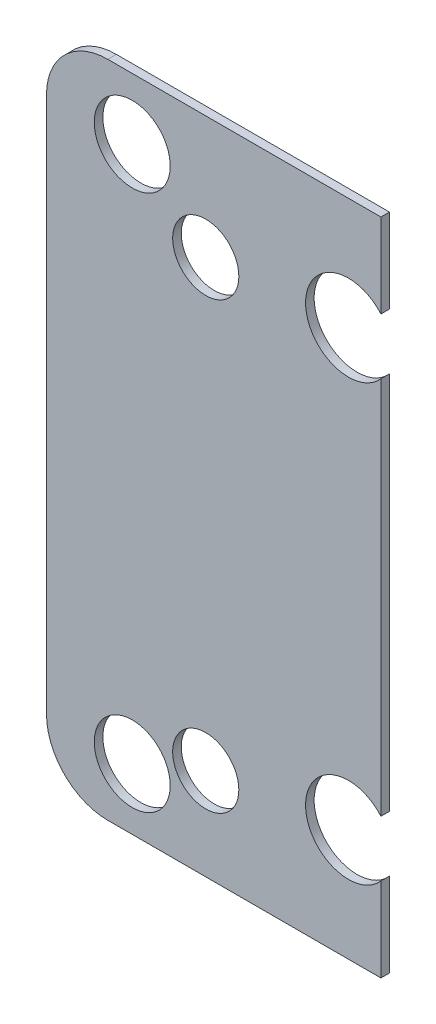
from build123d import *

# Parameters (mm, degrees)
SKETCH_1_W           = 76
SKETCH_1_H           = 60
EXTRUDE_1_DEPTH      = 0.7
SKETCH_5_W           = 76
SKETCH_5_H           = 60
CUT_EXTRUDE_4_DEPTH  = 10
CUT_EXTRUDE_8_DEPTH  = 0.7
SKETCH_17_R          = 2.5
CUT_EXTRUDE_9_DEPTH  = 45.069377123
SKETCH_29_R          = 3
EXTRUDE_3_DEPTH      = 0.6
CUT_EXTRUDE_18_DEPTH = 5
SKETCH_34_R          = 3
SKETCH_34_R_2        = 3.5
CUT_EXTRUDE_22_DEPTH = 5
SKETCH_33_R          = 3.2
CUT_EXTRUDE_23_DEPTH = 5
SKETCH_35_R          = 2.6
CUT_EXTRUDE_24_DEPTH = 10
CUT_EXTRUDE_27_DEPTH = 10
SKETCH_41_R          = 3.1
CUT_EXTRUDE_34_DEPTH = 10
CUT_EXTRUDE_35_DEPTH = 10
SKETCH_43_R          = 2.7
CUT_EXTRUDE_36_DEPTH = 45.069377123


with BuildPart() as part:
    # Sketch 1 → Extrude 1 (new body)
    with BuildSketch(Plane.XY):
        Rectangle(SKETCH_1_W, SKETCH_1_H)
    extrude(amount=EXTRUDE_1_DEPTH)

    # Sketch 5 → Cut-Extrude 4 (cut)
    with BuildSketch(Plane.XY.offset(0.7)):
        Rectangle(SKETCH_5_W, SKETCH_5_H)
        with BuildLine():
            Line((-34.9, 21.9), (-34.9, -21.9))
            ThreePointArc((-34.9, -21.9), (-33.435533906, -25.435533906), (-29.9, -26.9))
            Line((-29.9, -26.9), (29.9, -26.9))
            ThreePointArc((29.9, -26.9), (33.435533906, -25.435533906), (34.9, -21.9))
            Line((34.9, -21.9), (34.9, 21.9))
            ThreePointArc((34.9, 21.9), (33.435533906, 25.435533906), (29.9, 26.9))
            Line((29.9, 26.9), (-29.9, 26.9))
            ThreePointArc((-29.9, 26.9), (-33.435533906, 25.435533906), (-34.9, 21.9))
        make_face(mode=Mode.SUBTRACT)
    extrude(amount=-CUT_EXTRUDE_4_DEPTH, mode=Mode.SUBTRACT)

    # Sketch 13 → Cut-Extrude 8 (cut)
    with BuildSketch(Plane.XY.offset(0.7)):
        with BuildLine():
            Line((0.357380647, 0.004961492), (6.196219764, 1.051194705))
            ThreePointArc((6.196219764, 1.051194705), (6.528171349, 1.272279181), (6.592796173, 1.665844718))
            ThreePointArc((6.592796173, 1.665844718), (3.4, 5.888972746), (-1.853734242, 6.542451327))
            ThreePointArc((-1.853734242, 6.542451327), (-2.162259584, 6.289701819), (-2.187748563, 5.891681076))
            Line((-2.187748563, 5.891681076), (-0.174393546, 0.311981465))
            ThreePointArc((-0.174393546, 0.311981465), (-0.1765, 0.305706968), (-0.182987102, 0.307019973))
            Line((-0.182987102, 0.307019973), (-4.008471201, 4.84048637))
            ThreePointArc((-4.008471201, 4.84048637), (-4.365911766, 5.017422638), (-4.739061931, 4.876606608))
            ThreePointArc((-4.739061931, 4.876606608), (-6.8, 0), (-4.739061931, -4.876606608))
            ThreePointArc((-4.739061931, -4.876606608), (-4.365911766, -5.017422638), (-4.008471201, -4.84048637))
            Line((-4.008471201, -4.84048637), (-0.182987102, -0.307019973))
            ThreePointArc((-0.182987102, -0.307019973), (-0.1765, -0.305706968), (-0.174393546, -0.311981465))
            Line((-0.174393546, -0.311981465), (-2.187748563, -5.891681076))
            ThreePointArc((-2.187748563, -5.891681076), (-2.162259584, -6.289701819), (-1.853734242, -6.542451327))
            ThreePointArc((-1.853734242, -6.542451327), (3.4, -5.888972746), (6.592796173, -1.665844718))
            ThreePointArc((6.592796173, -1.665844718), (6.528171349, -1.272279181), (6.196219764, -1.051194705))
            Line((6.196219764, -1.051194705), (0.357380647, -0.004961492))
            ThreePointArc((0.357380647, -0.004961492), (0.353, 0), (0.357380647, 0.004961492))
        make_face()
    extrude(amount=-CUT_EXTRUDE_8_DEPTH, mode=Mode.SUBTRACT)

    # Sketch 17 → Cut-Extrude 9 (cut, through all)
    with BuildSketch(Plane.XY.offset(0.7)):
        with Locations((-21.9, 16.9)):
            Circle(SKETCH_17_R)
        with Locations(Location((21.9, 16.9, 0), (0, 0, 180))):
            Circle(SKETCH_17_R)
        with Locations((-21.9, -19.4)):
            Circle(SKETCH_17_R)
    extrude(amount=-CUT_EXTRUDE_9_DEPTH, mode=Mode.SUBTRACT)

    # Sketch 29 → Extrude 3 (add)
    with BuildSketch(Plane.XY.offset(0.7)):
        with Locations((-27.9, 21.9)):
            Circle(SKETCH_29_R)
        with Locations(Location((27.9, 21.9, 0), (0, 0, 180))):
            Circle(SKETCH_29_R)
        with Locations((27.9, -21.9)):
            Circle(SKETCH_29_R)
        with Locations(Location((-27.9, -21.9, 0), (0, 0, 180))):
            Circle(SKETCH_29_R)
    extrude(amount=EXTRUDE_3_DEPTH)

    # Sketch 31 → Cut-Extrude 18 (cut, symmetric)
    with BuildSketch(Plane.XY.offset(0.7)):
        with BuildLine():
            Line((0, 26.9), (0, 40))
            Line((0, 40), (-2.5, 40))
            ThreePointArc((-2.5, 40), (-4.267766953, 39.267766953), (-5, 37.5))
            Line((-5, 37.5), (-5, 26.9))
            Line((-5, 26.9), (0, 26.9))
        make_face()
        with BuildLine():
            ThreePointArc((5, 37.5), (4.267766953, 39.267766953), (2.5, 40))
            Line((2.5, 40), (0, 40))
            Line((0, 40), (0, 26.9))
            Line((0, 26.9), (5, 26.9))
            Line((5, 26.9), (5, 37.5))
        make_face()
        with BuildLine():
            Line((0, 6.8), (0, 26.9))
            Line((0, 26.9), (-5, 26.9))
            Line((-5, 26.9), (-5, 4.608687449))
            ThreePointArc((-5, 4.608687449), (-4.871373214, 4.744441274), (-4.739061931, 4.876606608))
            ThreePointArc((-4.739061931, 4.876606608), (-4.365911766, 5.017422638), (-4.008471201, 4.84048637))
            Line((-4.008471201, 4.84048637), (-0.182987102, 0.307019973))
            ThreePointArc((-0.182987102, 0.307019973), (-0.1765, 0.305706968), (-0.174393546, 0.311981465))
            Line((-0.174393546, 0.311981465), (-2.187748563, 5.891681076))
            ThreePointArc((-2.187748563, 5.891681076), (-2.162259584, 6.289701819), (-1.853734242, 6.542451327))
            ThreePointArc((-1.853734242, 6.542451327), (-0.935769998, 6.735305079), (0, 6.8))
        make_face()
        with BuildLine():
            Line((5, 26.9), (0, 26.9))
            Line((0, 26.9), (0, 6.8))
            ThreePointArc((0, 6.8), (2.729553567, 6.228124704), (5, 4.608687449))
            Line((5, 4.608687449), (5, 26.9))
        make_face()
        with BuildLine():
            Line((0, -26.9), (0, -6.8))
            ThreePointArc((0, -6.8), (-0.935769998, -6.735305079), (-1.853734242, -6.542451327))
            ThreePointArc((-1.853734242, -6.542451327), (-2.162259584, -6.289701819), (-2.187748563, -5.891681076))
            Line((-2.187748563, -5.891681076), (-0.174393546, -0.311981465))
            ThreePointArc((-0.174393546, -0.311981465), (-0.1765, -0.305706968), (-0.182987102, -0.307019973))
            Line((-0.182987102, -0.307019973), (-4.008471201, -4.84048637))
            ThreePointArc((-4.008471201, -4.84048637), (-4.365911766, -5.017422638), (-4.739061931, -4.876606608))
            ThreePointArc((-4.739061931, -4.876606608), (-4.871373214, -4.744441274), (-5, -4.608687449))
            Line((-5, -4.608687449), (-5, -26.9))
            Line((-5, -26.9), (0, -26.9))
        make_face()
        with BuildLine():
            Line((0, 0), (0, 6.8))
            ThreePointArc((0, 6.8), (-0.935769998, 6.735305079), (-1.853734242, 6.542451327))
            ThreePointArc((-1.853734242, 6.542451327), (-2.162259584, 6.289701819), (-2.187748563, 5.891681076))
            Line((-2.187748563, 5.891681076), (-0.174393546, 0.311981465))
            ThreePointArc((-0.174393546, 0.311981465), (-0.1765, 0.305706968), (-0.182987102, 0.307019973))
            Line((-0.182987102, 0.307019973), (-4.008471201, 4.84048637))
            ThreePointArc((-4.008471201, 4.84048637), (-4.365911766, 5.017422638), (-4.739061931, 4.876606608))
            ThreePointArc((-4.739061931, 4.876606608), (-4.871373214, 4.744441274), (-5, 4.608687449))
            Line((-5, 4.608687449), (-5, 0))
            Line((-5, 0), (0, 0))
        make_face()
        with BuildLine():
            Line((0, -6.8), (0, 0))
            Line((0, 0), (-5, 0))
            Line((-5, 0), (-5, -4.608687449))
            ThreePointArc((-5, -4.608687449), (-4.871373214, -4.744441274), (-4.739061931, -4.876606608))
            ThreePointArc((-4.739061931, -4.876606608), (-4.365911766, -5.017422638), (-4.008471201, -4.84048637))
            Line((-4.008471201, -4.84048637), (-0.182987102, -0.307019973))
            ThreePointArc((-0.182987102, -0.307019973), (-0.1765, -0.305706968), (-0.174393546, -0.311981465))
            Line((-0.174393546, -0.311981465), (-2.187748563, -5.891681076))
            ThreePointArc((-2.187748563, -5.891681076), (-2.162259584, -6.289701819), (-1.853734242, -6.542451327))
            ThreePointArc((-1.853734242, -6.542451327), (-0.935769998, -6.735305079), (0, -6.8))
        make_face()
        with BuildLine():
            Line((0.353, 0), (0, 0))
            Line((0, 0), (0, -6.8))
            ThreePointArc((0, -6.8), (2.729553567, -6.228124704), (5, -4.608687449))
            Line((5, -4.608687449), (5, -0.836849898))
            Line((5, -0.836849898), (0.357380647, -0.004961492))
            ThreePointArc((0.357380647, -0.004961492), (0.354251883, -0.003309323), (0.353, 0))
        make_face()
        with BuildLine():
            ThreePointArc((5, 4.608687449), (2.729553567, 6.228124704), (0, 6.8))
            Line((0, 6.8), (0, 0))
            Line((0, 0), (0.353, 0))
            ThreePointArc((0.353, 0), (0.354251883, 0.003309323), (0.357380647, 0.004961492))
            Line((0.357380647, 0.004961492), (5, 0.836849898))
            Line((5, 0.836849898), (5, 4.608687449))
        make_face()
        with BuildLine():
            ThreePointArc((5, -4.608687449), (2.729553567, -6.228124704), (0, -6.8))
            Line((0, -6.8), (0, -26.9))
            Line((0, -26.9), (5, -26.9))
            Line((5, -26.9), (5, -4.608687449))
        make_face()
        with BuildLine():
            Line((0, -40), (0, -26.9))
            Line((0, -26.9), (-5, -26.9))
            Line((-5, -26.9), (-5, -37.5))
            ThreePointArc((-5, -37.5), (-4.267766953, -39.267766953), (-2.5, -40))
            Line((-2.5, -40), (0, -40))
        make_face()
        with BuildLine():
            Line((5, -26.9), (0, -26.9))
            Line((0, -26.9), (0, -40))
            Line((0, -40), (2.5, -40))
            ThreePointArc((2.5, -40), (4.267766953, -39.267766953), (5, -37.5))
            Line((5, -37.5), (5, -26.9))
        make_face()
    extrude(amount=CUT_EXTRUDE_18_DEPTH, both=True, mode=Mode.SUBTRACT)


with BuildPart() as cut_extrude_18_piece_1:
    # of the separate pieces the step leaves, piece 1, a body of its own (cut_extrude_18_pieces)
    add(part.part.solids().sort_by_distance((34.9, 21.9, 0))[0])


with BuildPart() as cut_extrude_18_piece_2:
    # of the separate pieces the step leaves, piece 2, a body of its own (cut_extrude_18_pieces)
    add(part.part.solids().sort_by_distance((-29.9, 26.9, 0))[0])


with BuildPart() as cut_extrude_22_tool:
    # Sketch 34 → Cut-Extrude 22 (new, symmetric)
    with BuildSketch(Plane.XY.offset(0.7)):
        with Locations((20.5, 0)):
            Circle(SKETCH_34_R)
        with Locations((-10.25, 17.753520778)):
            Circle(SKETCH_34_R_2)
        with Locations((-10.25, -17.753520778)):
            Circle(SKETCH_34_R_2)
    extrude(amount=CUT_EXTRUDE_22_DEPTH, both=True)


with BuildPart() as cut_extrude_18_piece_1_1:
    add(cut_extrude_18_piece_1.part)

    # Cut-Extrude 22: cut by cut_extrude_22_tool
    add(cut_extrude_22_tool.part, mode=Mode.SUBTRACT)

    # Sketch 33 → Cut-Extrude 23 (cut, symmetric)
    with BuildSketch(Plane.XY.offset(0.7)):
        with Locations((27.9, -21.9)):
            Circle(SKETCH_33_R)
        with Locations((27.9, 21.9)):
            Circle(SKETCH_33_R)
    extrude(amount=CUT_EXTRUDE_23_DEPTH, both=True, mode=Mode.SUBTRACT)

    # Sketch 35 → Cut-Extrude 24 (cut)
    with BuildSketch(Plane.XY.offset(0.7)):
        with Locations((21.9, 16.9)):
            Circle(SKETCH_35_R)
        with Locations((-21.9, 16.9)):
            Circle(SKETCH_35_R)
        with Locations((-21.9, -19.4)):
            Circle(SKETCH_35_R)
    extrude(amount=-CUT_EXTRUDE_24_DEPTH, mode=Mode.SUBTRACT)

    # Sketch 37 → Cut-Extrude 27 (cut)
    with BuildSketch(Plane.XY.offset(0.7)):
        with BuildLine():
            Line((5, -26.9), (29.9, -26.9))
            ThreePointArc((29.9, -26.9), (33.435533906, -25.435533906), (34.9, -21.9))
            Line((34.9, -21.9), (34.9, 21.9))
            ThreePointArc((34.9, 21.9), (33.435533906, 25.435533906), (29.9, 26.9))
            Line((29.9, 26.9), (5, 26.9))
            Line((5, 26.9), (5, 4.608687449))
            ThreePointArc((5, 4.608687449), (5.980243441, 3.236771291), (6.592796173, 1.665844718))
            ThreePointArc((6.592796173, 1.665844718), (6.528171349, 1.272279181), (6.196219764, 1.051194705))
            Line((6.196219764, 1.051194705), (0.357380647, 0.004961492))
            ThreePointArc((0.357380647, 0.004961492), (0.353, 0), (0.357380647, -0.004961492))
            Line((0.357380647, -0.004961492), (6.196219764, -1.051194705))
            ThreePointArc((6.196219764, -1.051194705), (6.528171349, -1.272279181), (6.592796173, -1.665844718))
            ThreePointArc((6.592796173, -1.665844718), (5.980243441, -3.236771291), (5, -4.608687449))
            Line((5, -4.608687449), (5, -26.9))
        make_face()
    extrude(amount=-CUT_EXTRUDE_27_DEPTH, mode=Mode.SUBTRACT)


with BuildPart() as cut_extrude_18_piece_2_1:
    add(cut_extrude_18_piece_2.part)

    # Cut-Extrude 22: cut by cut_extrude_22_tool
    add(cut_extrude_22_tool.part, mode=Mode.SUBTRACT)

    # Sketch 41 → Cut-Extrude 34 (cut)
    with BuildSketch(Plane.XY.offset(1.3)):
        with Locations((-27.9, -21.9)):
            Circle(SKETCH_41_R)
        with Locations((-27.9, 21.9)):
            Circle(SKETCH_41_R)
    extrude(amount=-CUT_EXTRUDE_34_DEPTH, mode=Mode.SUBTRACT)

    # Sketch 42 → Cut-Extrude 35 (cut)
    with BuildSketch(Plane.XY.offset(0.7)):
        with BuildLine():
            ThreePointArc((-5, -4.608687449), (-6.8, 0), (-5, 4.608687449))
            Line((-5, 4.608687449), (-5, 26.9))
            Line((-5, 26.9), (-7.6, 26.9))
            Line((-7.6, 26.9), (-7.6, 4.608687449))
            Line((-7.6, 4.608687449), (-7.6, -4.608687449))
            Line((-7.6, -4.608687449), (-7.6, -26.9))
            Line((-7.6, -26.9), (-5, -26.9))
            Line((-5, -26.9), (-5, -4.608687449))
        make_face()
        with BuildLine():
            Line((-5, -4.608687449), (-5, 4.608687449))
            ThreePointArc((-5, 4.608687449), (-6.8, 0), (-5, -4.608687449))
        make_face()
    extrude(amount=-CUT_EXTRUDE_35_DEPTH, mode=Mode.SUBTRACT)

    # Sketch 43 → Cut-Extrude 36 (cut, through all)
    with BuildSketch(Plane.XY.offset(0.7)):
        with Locations((-21.9, 16.9)):
            Circle(SKETCH_43_R)
        with Locations((-21.9, -19.4)):
            Circle(SKETCH_43_R)
    extrude(amount=-CUT_EXTRUDE_36_DEPTH, mode=Mode.SUBTRACT)


solid = cut_extrude_18_piece_2_1.part
